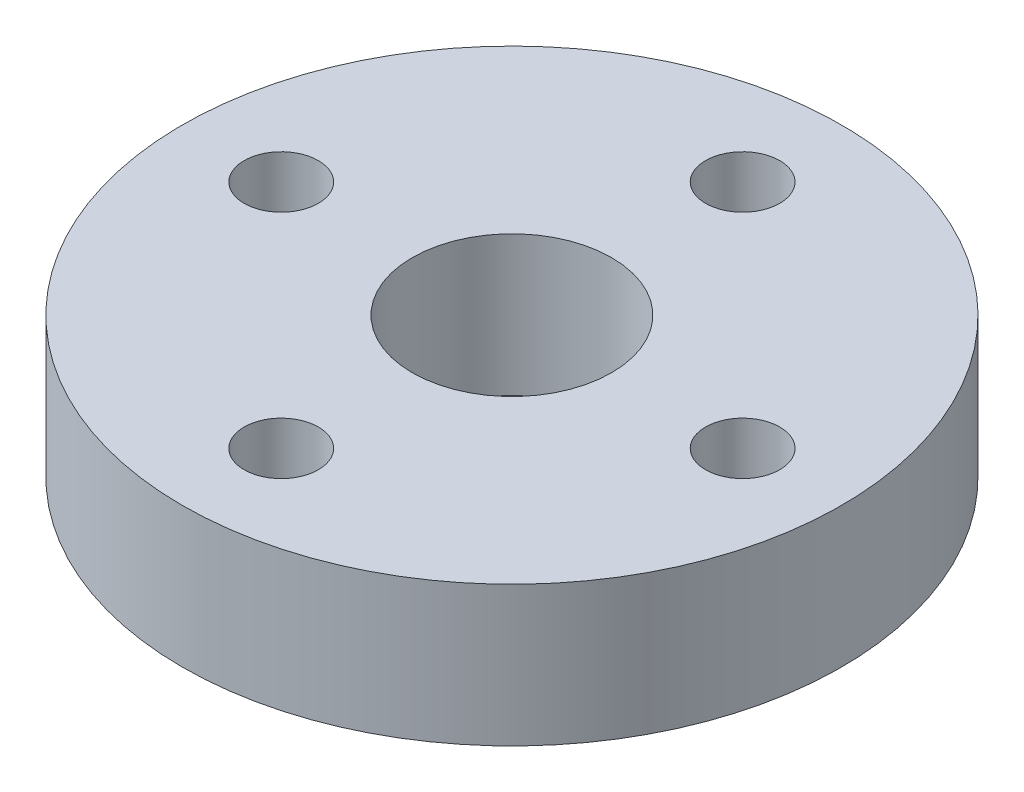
from build123d import *

# Parameters (mm, degrees)
SKETCH1_R           = 10
SKETCH1_R_2         = 3.025
BOSS_EXTRUDE1_DEPTH = 4.25
CUT_EXTRUDE1_DEPTH  = 2
SKETCH4_R           = 1.125
CUT_EXTRUDE2_DEPTH  = 15.320003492
SKETCH5_R           = 10
SKETCH5_R_2         = 1.125
SKETCH5_R_3         = 3.025
BOSS_EXTRUDE2_DEPTH = 4.25
SHELL1_T            = -1


with BuildPart() as part:
    # Sketch1 → Boss-Extrude1 (new body)
    with BuildSketch(Plane(origin=(0, 0, 0), x_dir=(1, 0, 0), z_dir=(0, 1, 0))):
        with Locations(Location((0, 0, 0), (0, 0, 270))):
            Circle(SKETCH1_R)
        with Locations(Location((0, 0, 0), (0, 0, 270))):
            Circle(SKETCH1_R_2, mode=Mode.SUBTRACT)
    extrude(amount=BOSS_EXTRUDE1_DEPTH)

    # Sketch3 → Cut-Extrude1 (cut)
    with BuildSketch(Plane.XZ):
        Polygon((7, 2.309401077), (5, 1.154700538), (5, -1.154700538), (7, -2.309401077), (9, -1.154700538), (9, 1.154700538), align=None)
        Polygon((-2.309401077, 7), (-1.154700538, 5), (1.154700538, 5), (2.309401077, 7), (1.154700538, 9), (-1.154700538, 9), align=None)
        Polygon((2.309401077, -7), (1.154700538, -5), (-1.154700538, -5), (-2.309401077, -7), (-1.154700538, -9), (1.154700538, -9), align=None)
        Polygon((-7, -2.309401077), (-5, -1.154700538), (-5, 1.154700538), (-7, 2.309401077), (-9, 1.154700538), (-9, -1.154700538), align=None)
    extrude(amount=-CUT_EXTRUDE1_DEPTH, mode=Mode.SUBTRACT)

    # Sketch4 → Cut-Extrude2 (cut, through all)
    with BuildSketch(Plane.XZ.offset(-2)):
        with Locations(Location((0, -7, 0), (0, 0, 270))):
            Circle(SKETCH4_R)
        with Locations(Location((0, 7, 0), (0, 0, 270))):
            Circle(SKETCH4_R)
        with Locations(Location((7, 0, 0), (0, 0, 270))):
            Circle(SKETCH4_R)
        with Locations(Location((-7, 0, 0), (0, 0, 270))):
            Circle(SKETCH4_R)
    extrude(amount=-CUT_EXTRUDE2_DEPTH, mode=Mode.SUBTRACT)

    # Sketch5 → Boss-Extrude2 (add)
    with BuildSketch(Plane.XZ):
        with Locations(Location((0, 0, 0), (0, 0, 90))):
            Circle(SKETCH5_R)
        with Locations(Location((7, 0, 0), (0, 0, 270))):
            Circle(SKETCH5_R_2, mode=Mode.SUBTRACT)
        with Locations(Location((0, -7, 0), (0, 0, 270))):
            Circle(SKETCH5_R_2, mode=Mode.SUBTRACT)
        with Locations(Location((-7, 0, 0), (0, 0, 270))):
            Circle(SKETCH5_R_2, mode=Mode.SUBTRACT)
        with Locations(Location((0, 7, 0), (0, 0, 270))):
            Circle(SKETCH5_R_2, mode=Mode.SUBTRACT)
        with Locations(Location((0, 0, 0), (0, 0, 90))):
            Circle(SKETCH5_R_3, mode=Mode.SUBTRACT)
    extrude(amount=-BOSS_EXTRUDE2_DEPTH)

    # Shell1
    shell1_openings = [part.faces().sort_by_distance(p)[0] for p in [
        (0, 0, -9.717157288),
    ]]
    offset(amount=SHELL1_T, openings=shell1_openings)


solid = part.part
